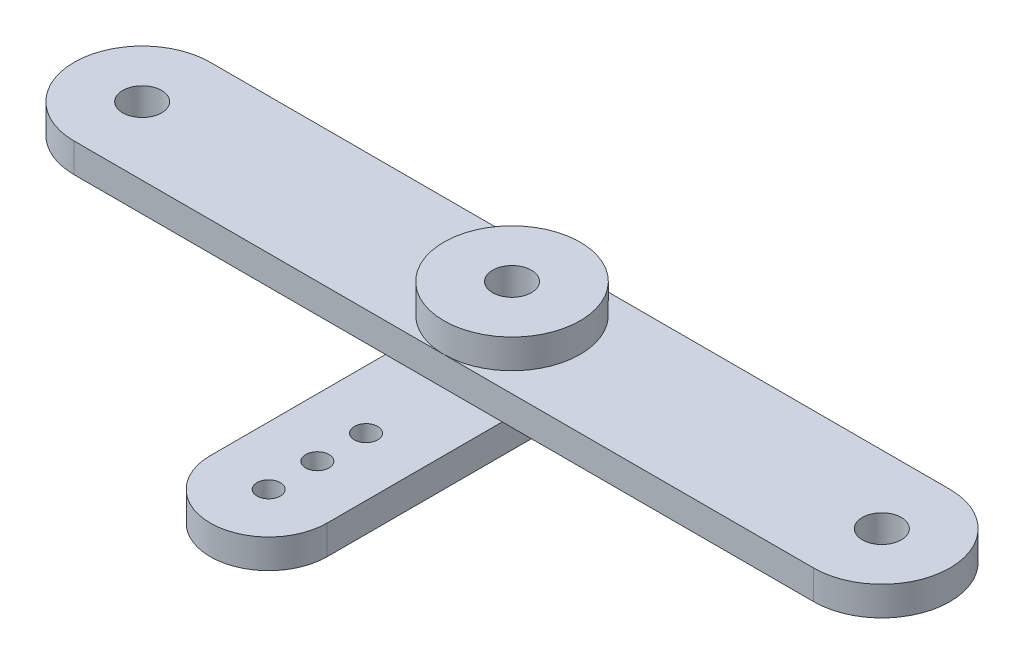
from build123d import *

# Parameters (mm, degrees)
ESQUISSE1_R        = 1
BOSS_EXTRU_1_DEPTH = 1.5
ESQUISSE2_R        = 3.5
ESQUISSE2_R_2      = 1
BOSS_EXTRU_2_DEPTH = 1.5
BOSS_EXTRU_3_START = 1.5
ESQUISSE3_R        = 0.6
ESQUISSE3_R_2      = 1
BOSS_EXTRU_3_DEPTH = 1.5


with BuildPart() as part:
    # Esquisse1 → Boss.-Extru.1 (new body)
    with BuildSketch(Plane(origin=(0, 0, 0), x_dir=(1, 0, 0), z_dir=(0, 1, 0))):
        with BuildLine():
            Line((-19, -3.5), (19, -3.5))
            ThreePointArc((19, -3.5), (22.5, 0), (19, 3.5))
            Line((19, 3.5), (-19, 3.5))
            ThreePointArc((-19, 3.5), (-22.5, 0), (-19, -3.5))
        make_face()
        with Locations(Location((19, 0, 0), (0, 0, 270))):
            Circle(ESQUISSE1_R, mode=Mode.SUBTRACT)
        with Locations(Location((-19, 0, 0), (0, 0, 90))):
            Circle(ESQUISSE1_R, mode=Mode.SUBTRACT)
        with Locations(Location((0, 0, 0), (0, 0, 270))):
            Circle(ESQUISSE1_R, mode=Mode.SUBTRACT)
    extrude(amount=BOSS_EXTRU_1_DEPTH)

    # Esquisse2 → Boss.-Extru.2 (add)
    with BuildSketch(Plane(origin=(0, 1.5, 0), x_dir=(1, 0, 0), z_dir=(0, 1, 0))):
        with Locations(Location((0, 0, 0), (0, 0, 270))):
            Circle(ESQUISSE2_R)
        with Locations(Location((0, 0, 0), (0, 0, 270))):
            Circle(ESQUISSE2_R_2, mode=Mode.SUBTRACT)
    extrude(amount=BOSS_EXTRU_2_DEPTH)

    # Esquisse3 → Boss.-Extru.3 (add)
    with BuildSketch(Plane.XZ.offset(BOSS_EXTRU_3_START)):
        with BuildLine():
            Line((3, 12.5), (3, -3.5))
            Line((3, -3.5), (-3, -3.5))
            Line((-3, -3.5), (-3, 12.5))
            ThreePointArc((-3, 12.5), (0, 15.5), (3, 12.5))
        make_face()
        with Locations(Location((0, 12.5, 0), (0, 0, 270))):
            Circle(ESQUISSE3_R, mode=Mode.SUBTRACT)
        with Locations(Location((0, 0, 0), (0, 0, 270))):
            Circle(ESQUISSE3_R_2, mode=Mode.SUBTRACT)
        with Locations(Location((0, 10, 0), (0, 0, 270))):
            Circle(ESQUISSE3_R, mode=Mode.SUBTRACT)
        with Locations(Location((0, 7.5, 0), (0, 0, 270))):
            Circle(ESQUISSE3_R, mode=Mode.SUBTRACT)
    extrude(amount=-BOSS_EXTRU_3_DEPTH)


solid = part.part
